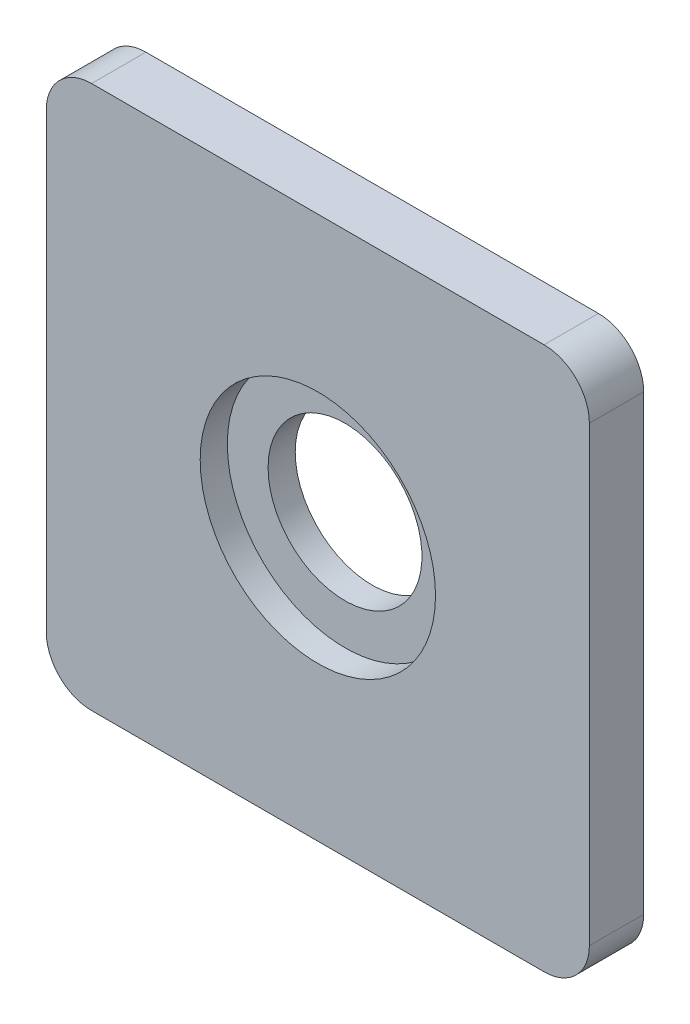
ISO-10303-21;
HEADER;
FILE_DESCRIPTION(('STEP AP214'),'2;1');
FILE_NAME('part.step','',(''),(''),'','','');
FILE_SCHEMA(('AUTOMOTIVE_DESIGN { 1 0 10303 214 1 1 1 1 }'));
ENDSEC;
DATA;
#1=APPLICATION_CONTEXT('core data for automotive mechanical design processes');
#2=APPLICATION_PROTOCOL_DEFINITION('international standard','automotive_design',2000,#1);
#3=PRODUCT_CONTEXT('',#1,'mechanical');
#4=PRODUCT('Part','Part','',(#3));
#5=PRODUCT_RELATED_PRODUCT_CATEGORY('part','',(#4));
#6=PRODUCT_DEFINITION_FORMATION('','',#4);
#7=PRODUCT_DEFINITION_CONTEXT('part definition',#1,'design');
#8=PRODUCT_DEFINITION('design','',#6,#7);
#9=PRODUCT_DEFINITION_SHAPE('','',#8);
#10=(LENGTH_UNIT() NAMED_UNIT(*) SI_UNIT(.MILLI.,.METRE.));
#11=(NAMED_UNIT(*) PLANE_ANGLE_UNIT() SI_UNIT($,.RADIAN.));
#12=(NAMED_UNIT(*) SI_UNIT($,.STERADIAN.) SOLID_ANGLE_UNIT());
#13=UNCERTAINTY_MEASURE_WITH_UNIT(LENGTH_MEASURE(1.E-05),#10,'distance_accuracy_value','');
#14=(GEOMETRIC_REPRESENTATION_CONTEXT(3) GLOBAL_UNCERTAINTY_ASSIGNED_CONTEXT((#13)) GLOBAL_UNIT_ASSIGNED_CONTEXT((#10,
#11,#12)) REPRESENTATION_CONTEXT('',''));
#15=CARTESIAN_POINT('',(0.,0.,0.));
#16=DIRECTION('',(0.,0.,1.));
#17=DIRECTION('',(1.,0.,0.));
#18=AXIS2_PLACEMENT_3D('',#15,#16,#17);
#19=CARTESIAN_POINT('',(15.,15.,2.24999999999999));
#20=DIRECTION('',(0.,0.,-1.));
#21=DIRECTION('',(-1.,0.,0.));
#22=AXIS2_PLACEMENT_3D('',#19,#20,#21);
#23=CYLINDRICAL_SURFACE('',#22,6.50000000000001);
#24=CARTESIAN_POINT('',(15.,15.,2.99999999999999));
#25=DIRECTION('',(0.,0.,-1.));
#26=DIRECTION('',(-1.,0.,0.));
#27=AXIS2_PLACEMENT_3D('',#24,#25,#26);
#28=CIRCLE('',#27,6.50000000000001);
#29=CARTESIAN_POINT('',(8.49999999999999,15.,2.99999999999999));
#30=VERTEX_POINT('',#29);
#31=EDGE_CURVE('E18',#30,#30,#28,.T.);
#32=ORIENTED_EDGE('',*,*,#31,.F.);
#33=EDGE_LOOP('',(#32));
#34=FACE_BOUND('',#33,.T.);
#35=CARTESIAN_POINT('',(15.,15.,1.49999999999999));
#36=DIRECTION('',(0.,0.,-1.));
#37=DIRECTION('',(-1.,0.,0.));
#38=AXIS2_PLACEMENT_3D('',#35,#36,#37);
#39=CIRCLE('',#38,6.50000000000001);
#40=CARTESIAN_POINT('',(8.49999999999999,15.,1.49999999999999));
#41=VERTEX_POINT('',#40);
#42=EDGE_CURVE('E101',#41,#41,#39,.T.);
#43=ORIENTED_EDGE('',*,*,#42,.T.);
#44=EDGE_LOOP('',(#43));
#45=FACE_BOUND('',#44,.T.);
#46=ADVANCED_FACE('F15',(#34,#45),#23,.F.);
#47=CARTESIAN_POINT('',(15.,15.,2.99999999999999));
#48=DIRECTION('',(0.,0.,1.));
#49=DIRECTION('',(1.,0.,0.));
#50=AXIS2_PLACEMENT_3D('',#47,#48,#49);
#51=PLANE('',#50);
#52=ORIENTED_EDGE('',*,*,#31,.T.);
#53=EDGE_LOOP('',(#52));
#54=FACE_BOUND('',#53,.T.);
#55=DIRECTION('',(1.,0.,0.));
#56=VECTOR('',#55,1.);
#57=CARTESIAN_POINT('',(2.50000000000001,30.,2.99999999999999));
#58=LINE('',#57,#56);
#59=CARTESIAN_POINT('',(2.50000000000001,30.,2.99999999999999));
#60=VERTEX_POINT('',#59);
#61=CARTESIAN_POINT('',(27.5,30.,2.99999999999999));
#62=VERTEX_POINT('',#61);
#63=EDGE_CURVE('E115',#60,#62,#58,.T.);
#64=ORIENTED_EDGE('',*,*,#63,.F.);
#65=CARTESIAN_POINT('',(2.50000000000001,27.5,2.99999999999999));
#66=DIRECTION('',(0.,0.,-1.));
#67=DIRECTION('',(-1.,0.,0.));
#68=AXIS2_PLACEMENT_3D('',#65,#66,#67);
#69=CIRCLE('',#68,2.50000000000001);
#70=CARTESIAN_POINT('',(0.,27.5,2.99999999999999));
#71=VERTEX_POINT('',#70);
#72=EDGE_CURVE('E136',#71,#60,#69,.T.);
#73=ORIENTED_EDGE('',*,*,#72,.F.);
#74=DIRECTION('',(0.,1.,0.));
#75=VECTOR('',#74,1.);
#76=CARTESIAN_POINT('',(0.,2.50000000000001,2.99999999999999));
#77=LINE('',#76,#75);
#78=CARTESIAN_POINT('',(0.,2.50000000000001,2.99999999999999));
#79=VERTEX_POINT('',#78);
#80=EDGE_CURVE('E111',#79,#71,#77,.T.);
#81=ORIENTED_EDGE('',*,*,#80,.F.);
#82=CARTESIAN_POINT('',(2.50000000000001,2.50000000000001,2.99999999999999));
#83=DIRECTION('',(0.,0.,-1.));
#84=DIRECTION('',(-1.,0.,0.));
#85=AXIS2_PLACEMENT_3D('',#82,#83,#84);
#86=CIRCLE('',#85,2.50000000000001);
#87=CARTESIAN_POINT('',(2.50000000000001,0.,2.99999999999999));
#88=VERTEX_POINT('',#87);
#89=EDGE_CURVE('E97',#88,#79,#86,.T.);
#90=ORIENTED_EDGE('',*,*,#89,.F.);
#91=DIRECTION('',(1.,0.,0.));
#92=VECTOR('',#91,1.);
#93=CARTESIAN_POINT('',(27.5,0.,2.99999999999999));
#94=LINE('',#93,#92);
#95=CARTESIAN_POINT('',(27.5,0.,2.99999999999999));
#96=VERTEX_POINT('',#95);
#97=EDGE_CURVE('E91',#96,#88,#94,.F.);
#98=ORIENTED_EDGE('',*,*,#97,.F.);
#99=CARTESIAN_POINT('',(27.5,2.50000000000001,2.99999999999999));
#100=DIRECTION('',(0.,0.,-1.));
#101=DIRECTION('',(-1.,0.,0.));
#102=AXIS2_PLACEMENT_3D('',#99,#100,#101);
#103=CIRCLE('',#102,2.50000000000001);
#104=CARTESIAN_POINT('',(30.,2.50000000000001,2.99999999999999));
#105=VERTEX_POINT('',#104);
#106=EDGE_CURVE('E82',#105,#96,#103,.T.);
#107=ORIENTED_EDGE('',*,*,#106,.F.);
#108=DIRECTION('',(0.,1.,0.));
#109=VECTOR('',#108,1.);
#110=CARTESIAN_POINT('',(30.,27.5,2.99999999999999));
#111=LINE('',#110,#109);
#112=CARTESIAN_POINT('',(30.,27.5,2.99999999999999));
#113=VERTEX_POINT('',#112);
#114=EDGE_CURVE('E77',#113,#105,#111,.F.);
#115=ORIENTED_EDGE('',*,*,#114,.F.);
#116=CARTESIAN_POINT('',(27.5,27.5,2.99999999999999));
#117=DIRECTION('',(0.,0.,-1.));
#118=DIRECTION('',(-1.,0.,0.));
#119=AXIS2_PLACEMENT_3D('',#116,#117,#118);
#120=CIRCLE('',#119,2.50000000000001);
#121=EDGE_CURVE('E138',#62,#113,#120,.T.);
#122=ORIENTED_EDGE('',*,*,#121,.F.);
#123=EDGE_LOOP('',(#64,#73,#81,#90,#98,#107,#115,#122));
#124=FACE_BOUND('',#123,.T.);
#125=ADVANCED_FACE('F95',(#54,#124),#51,.T.);
#126=CARTESIAN_POINT('',(15.,15.,1.49999999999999));
#127=DIRECTION('',(0.,0.,-1.));
#128=DIRECTION('',(-1.,0.,0.));
#129=AXIS2_PLACEMENT_3D('',#126,#127,#128);
#130=PLANE('',#129);
#131=CARTESIAN_POINT('',(15.,15.,1.49999999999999));
#132=DIRECTION('',(0.,0.,-1.));
#133=DIRECTION('',(-1.,0.,0.));
#134=AXIS2_PLACEMENT_3D('',#131,#132,#133);
#135=CIRCLE('',#134,4.24999999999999);
#136=CARTESIAN_POINT('',(10.75,15.,1.49999999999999));
#137=VERTEX_POINT('',#136);
#138=EDGE_CURVE('E131',#137,#137,#135,.T.);
#139=ORIENTED_EDGE('',*,*,#138,.T.);
#140=EDGE_LOOP('',(#139));
#141=FACE_BOUND('',#140,.T.);
#142=ORIENTED_EDGE('',*,*,#42,.F.);
#143=EDGE_LOOP('',(#142));
#144=FACE_BOUND('',#143,.T.);
#145=ADVANCED_FACE('F151',(#141,#144),#130,.F.);
#146=CARTESIAN_POINT('',(27.5,0.,0.));
#147=DIRECTION('',(0.,-1.,0.));
#148=DIRECTION('',(0.,0.,-1.));
#149=AXIS2_PLACEMENT_3D('',#146,#147,#148);
#150=PLANE('',#149);
#151=DIRECTION('',(1.,0.,0.));
#152=VECTOR('',#151,1.);
#153=CARTESIAN_POINT('',(15.,0.,0.));
#154=LINE('',#153,#152);
#155=CARTESIAN_POINT('',(2.50000000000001,0.,0.));
#156=VERTEX_POINT('',#155);
#157=CARTESIAN_POINT('',(27.5,0.,0.));
#158=VERTEX_POINT('',#157);
#159=EDGE_CURVE('E105',#156,#158,#154,.T.);
#160=ORIENTED_EDGE('',*,*,#159,.T.);
#161=DIRECTION('',(0.,0.,-1.));
#162=VECTOR('',#161,1.);
#163=CARTESIAN_POINT('',(27.5,0.,0.));
#164=LINE('',#163,#162);
#165=EDGE_CURVE('E87',#96,#158,#164,.T.);
#166=ORIENTED_EDGE('',*,*,#165,.F.);
#167=ORIENTED_EDGE('',*,*,#97,.T.);
#168=DIRECTION('',(0.,0.,-1.));
#169=VECTOR('',#168,1.);
#170=CARTESIAN_POINT('',(2.50000000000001,0.,0.));
#171=LINE('',#170,#169);
#172=EDGE_CURVE('E134',#156,#88,#171,.F.);
#173=ORIENTED_EDGE('',*,*,#172,.F.);
#174=EDGE_LOOP('',(#160,#166,#167,#173));
#175=FACE_BOUND('',#174,.T.);
#176=ADVANCED_FACE('F104',(#175),#150,.T.);
#177=CARTESIAN_POINT('',(27.5,2.50000000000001,0.));
#178=DIRECTION('',(0.,0.,-1.));
#179=DIRECTION('',(-1.,0.,0.));
#180=AXIS2_PLACEMENT_3D('',#177,#178,#179);
#181=CYLINDRICAL_SURFACE('',#180,2.50000000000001);
#182=CARTESIAN_POINT('',(27.5,2.50000000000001,0.));
#183=DIRECTION('',(0.,0.,-1.));
#184=DIRECTION('',(-1.,0.,0.));
#185=AXIS2_PLACEMENT_3D('',#182,#183,#184);
#186=CIRCLE('',#185,2.50000000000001);
#187=CARTESIAN_POINT('',(30.,2.50000000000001,0.));
#188=VERTEX_POINT('',#187);
#189=EDGE_CURVE('E129',#158,#188,#186,.F.);
#190=ORIENTED_EDGE('',*,*,#189,.T.);
#191=DIRECTION('',(0.,0.,-1.));
#192=VECTOR('',#191,1.);
#193=CARTESIAN_POINT('',(30.,2.50000000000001,0.));
#194=LINE('',#193,#192);
#195=EDGE_CURVE('E89',#105,#188,#194,.T.);
#196=ORIENTED_EDGE('',*,*,#195,.F.);
#197=ORIENTED_EDGE('',*,*,#106,.T.);
#198=ORIENTED_EDGE('',*,*,#165,.T.);
#199=EDGE_LOOP('',(#190,#196,#197,#198));
#200=FACE_BOUND('',#199,.T.);
#201=ADVANCED_FACE('F85',(#200),#181,.T.);
#202=CARTESIAN_POINT('',(30.,27.5,0.));
#203=DIRECTION('',(1.,0.,0.));
#204=DIRECTION('',(0.,0.,-1.));
#205=AXIS2_PLACEMENT_3D('',#202,#203,#204);
#206=PLANE('',#205);
#207=DIRECTION('',(0.,1.,0.));
#208=VECTOR('',#207,1.);
#209=CARTESIAN_POINT('',(30.,15.,0.));
#210=LINE('',#209,#208);
#211=CARTESIAN_POINT('',(30.,27.5,0.));
#212=VERTEX_POINT('',#211);
#213=EDGE_CURVE('E128',#188,#212,#210,.T.);
#214=ORIENTED_EDGE('',*,*,#213,.T.);
#215=DIRECTION('',(0.,0.,-1.));
#216=VECTOR('',#215,1.);
#217=CARTESIAN_POINT('',(30.,27.5,0.));
#218=LINE('',#217,#216);
#219=EDGE_CURVE('E117',#113,#212,#218,.T.);
#220=ORIENTED_EDGE('',*,*,#219,.F.);
#221=ORIENTED_EDGE('',*,*,#114,.T.);
#222=ORIENTED_EDGE('',*,*,#195,.T.);
#223=EDGE_LOOP('',(#214,#220,#221,#222));
#224=FACE_BOUND('',#223,.T.);
#225=ADVANCED_FACE('F183',(#224),#206,.T.);
#226=CARTESIAN_POINT('',(27.5,27.5,0.));
#227=DIRECTION('',(0.,0.,-1.));
#228=DIRECTION('',(-1.,0.,0.));
#229=AXIS2_PLACEMENT_3D('',#226,#227,#228);
#230=CYLINDRICAL_SURFACE('',#229,2.50000000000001);
#231=CARTESIAN_POINT('',(27.5,27.5,0.));
#232=DIRECTION('',(0.,0.,-1.));
#233=DIRECTION('',(-1.,0.,0.));
#234=AXIS2_PLACEMENT_3D('',#231,#232,#233);
#235=CIRCLE('',#234,2.50000000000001);
#236=CARTESIAN_POINT('',(27.5,30.,0.));
#237=VERTEX_POINT('',#236);
#238=EDGE_CURVE('E125',#212,#237,#235,.F.);
#239=ORIENTED_EDGE('',*,*,#238,.T.);
#240=DIRECTION('',(0.,0.,1.));
#241=VECTOR('',#240,1.);
#242=CARTESIAN_POINT('',(27.5,30.,0.));
#243=LINE('',#242,#241);
#244=EDGE_CURVE('E116',#62,#237,#243,.F.);
#245=ORIENTED_EDGE('',*,*,#244,.F.);
#246=ORIENTED_EDGE('',*,*,#121,.T.);
#247=ORIENTED_EDGE('',*,*,#219,.T.);
#248=EDGE_LOOP('',(#239,#245,#246,#247));
#249=FACE_BOUND('',#248,.T.);
#250=ADVANCED_FACE('F179',(#249),#230,.T.);
#251=CARTESIAN_POINT('',(2.50000000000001,30.,0.));
#252=DIRECTION('',(0.,1.,0.));
#253=DIRECTION('',(0.,0.,1.));
#254=AXIS2_PLACEMENT_3D('',#251,#252,#253);
#255=PLANE('',#254);
#256=DIRECTION('',(1.,0.,0.));
#257=VECTOR('',#256,1.);
#258=CARTESIAN_POINT('',(15.,30.,0.));
#259=LINE('',#258,#257);
#260=CARTESIAN_POINT('',(2.50000000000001,30.,0.));
#261=VERTEX_POINT('',#260);
#262=EDGE_CURVE('E124',#237,#261,#259,.F.);
#263=ORIENTED_EDGE('',*,*,#262,.T.);
#264=DIRECTION('',(0.,0.,-1.));
#265=VECTOR('',#264,1.);
#266=CARTESIAN_POINT('',(2.50000000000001,30.,0.));
#267=LINE('',#266,#265);
#268=EDGE_CURVE('E114',#60,#261,#267,.T.);
#269=ORIENTED_EDGE('',*,*,#268,.F.);
#270=ORIENTED_EDGE('',*,*,#63,.T.);
#271=ORIENTED_EDGE('',*,*,#244,.T.);
#272=EDGE_LOOP('',(#263,#269,#270,#271));
#273=FACE_BOUND('',#272,.T.);
#274=ADVANCED_FACE('F175',(#273),#255,.T.);
#275=CARTESIAN_POINT('',(2.50000000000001,27.5,0.));
#276=DIRECTION('',(0.,0.,-1.));
#277=DIRECTION('',(-1.,0.,0.));
#278=AXIS2_PLACEMENT_3D('',#275,#276,#277);
#279=CYLINDRICAL_SURFACE('',#278,2.50000000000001);
#280=CARTESIAN_POINT('',(2.50000000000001,27.5,0.));
#281=DIRECTION('',(0.,0.,-1.));
#282=DIRECTION('',(-1.,0.,0.));
#283=AXIS2_PLACEMENT_3D('',#280,#281,#282);
#284=CIRCLE('',#283,2.50000000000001);
#285=CARTESIAN_POINT('',(0.,27.5,0.));
#286=VERTEX_POINT('',#285);
#287=EDGE_CURVE('E121',#261,#286,#284,.F.);
#288=ORIENTED_EDGE('',*,*,#287,.T.);
#289=DIRECTION('',(0.,0.,1.));
#290=VECTOR('',#289,1.);
#291=CARTESIAN_POINT('',(0.,27.5,0.));
#292=LINE('',#291,#290);
#293=EDGE_CURVE('E113',#71,#286,#292,.F.);
#294=ORIENTED_EDGE('',*,*,#293,.F.);
#295=ORIENTED_EDGE('',*,*,#72,.T.);
#296=ORIENTED_EDGE('',*,*,#268,.T.);
#297=EDGE_LOOP('',(#288,#294,#295,#296));
#298=FACE_BOUND('',#297,.T.);
#299=ADVANCED_FACE('F171',(#298),#279,.T.);
#300=CARTESIAN_POINT('',(0.,2.50000000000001,0.));
#301=DIRECTION('',(-1.,0.,0.));
#302=DIRECTION('',(0.,0.,1.));
#303=AXIS2_PLACEMENT_3D('',#300,#301,#302);
#304=PLANE('',#303);
#305=DIRECTION('',(0.,1.,0.));
#306=VECTOR('',#305,1.);
#307=CARTESIAN_POINT('',(0.,15.,0.));
#308=LINE('',#307,#306);
#309=CARTESIAN_POINT('',(0.,2.50000000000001,0.));
#310=VERTEX_POINT('',#309);
#311=EDGE_CURVE('E120',#286,#310,#308,.F.);
#312=ORIENTED_EDGE('',*,*,#311,.T.);
#313=DIRECTION('',(0.,0.,-1.));
#314=VECTOR('',#313,1.);
#315=CARTESIAN_POINT('',(0.,2.50000000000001,0.));
#316=LINE('',#315,#314);
#317=EDGE_CURVE('E33',#79,#310,#316,.T.);
#318=ORIENTED_EDGE('',*,*,#317,.F.);
#319=ORIENTED_EDGE('',*,*,#80,.T.);
#320=ORIENTED_EDGE('',*,*,#293,.T.);
#321=EDGE_LOOP('',(#312,#318,#319,#320));
#322=FACE_BOUND('',#321,.T.);
#323=ADVANCED_FACE('F168',(#322),#304,.T.);
#324=CARTESIAN_POINT('',(2.50000000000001,2.50000000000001,0.));
#325=DIRECTION('',(0.,0.,-1.));
#326=DIRECTION('',(-1.,0.,0.));
#327=AXIS2_PLACEMENT_3D('',#324,#325,#326);
#328=CYLINDRICAL_SURFACE('',#327,2.50000000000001);
#329=CARTESIAN_POINT('',(2.50000000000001,2.50000000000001,0.));
#330=DIRECTION('',(0.,0.,-1.));
#331=DIRECTION('',(-1.,0.,0.));
#332=AXIS2_PLACEMENT_3D('',#329,#330,#331);
#333=CIRCLE('',#332,2.50000000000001);
#334=EDGE_CURVE('E24',#310,#156,#333,.F.);
#335=ORIENTED_EDGE('',*,*,#334,.T.);
#336=ORIENTED_EDGE('',*,*,#172,.T.);
#337=ORIENTED_EDGE('',*,*,#89,.T.);
#338=ORIENTED_EDGE('',*,*,#317,.T.);
#339=EDGE_LOOP('',(#335,#336,#337,#338));
#340=FACE_BOUND('',#339,.T.);
#341=ADVANCED_FACE('F160',(#340),#328,.T.);
#342=CARTESIAN_POINT('',(15.,15.,1.55));
#343=DIRECTION('',(0.,0.,-1.));
#344=DIRECTION('',(-1.,0.,0.));
#345=AXIS2_PLACEMENT_3D('',#342,#343,#344);
#346=CYLINDRICAL_SURFACE('',#345,4.24999999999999);
#347=ORIENTED_EDGE('',*,*,#138,.F.);
#348=EDGE_LOOP('',(#347));
#349=FACE_BOUND('',#348,.T.);
#350=CARTESIAN_POINT('',(15.,15.,0.));
#351=DIRECTION('',(0.,0.,-1.));
#352=DIRECTION('',(-1.,0.,0.));
#353=AXIS2_PLACEMENT_3D('',#350,#351,#352);
#354=CIRCLE('',#353,4.24999999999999);
#355=CARTESIAN_POINT('',(10.75,15.,0.));
#356=VERTEX_POINT('',#355);
#357=EDGE_CURVE('E10',#356,#356,#354,.T.);
#358=ORIENTED_EDGE('',*,*,#357,.T.);
#359=EDGE_LOOP('',(#358));
#360=FACE_BOUND('',#359,.T.);
#361=ADVANCED_FACE('F154',(#349,#360),#346,.F.);
#362=CARTESIAN_POINT('',(15.,15.,0.));
#363=DIRECTION('',(0.,0.,1.));
#364=DIRECTION('',(1.,0.,0.));
#365=AXIS2_PLACEMENT_3D('',#362,#363,#364);
#366=PLANE('',#365);
#367=ORIENTED_EDGE('',*,*,#357,.F.);
#368=EDGE_LOOP('',(#367));
#369=FACE_BOUND('',#368,.T.);
#370=ORIENTED_EDGE('',*,*,#311,.F.);
#371=ORIENTED_EDGE('',*,*,#287,.F.);
#372=ORIENTED_EDGE('',*,*,#262,.F.);
#373=ORIENTED_EDGE('',*,*,#238,.F.);
#374=ORIENTED_EDGE('',*,*,#213,.F.);
#375=ORIENTED_EDGE('',*,*,#189,.F.);
#376=ORIENTED_EDGE('',*,*,#159,.F.);
#377=ORIENTED_EDGE('',*,*,#334,.F.);
#378=EDGE_LOOP('',(#370,#371,#372,#373,#374,#375,#376,#377));
#379=FACE_BOUND('',#378,.T.);
#380=ADVANCED_FACE('F152',(#369,#379),#366,.F.);
#381=CLOSED_SHELL('',(#46,#125,#145,#176,#201,#225,#250,#274,#299,#323,#341,#361,#380));
#382=MANIFOLD_SOLID_BREP('B1',#381);
#383=ADVANCED_BREP_SHAPE_REPRESENTATION('',(#18,#382),#14);
#384=SHAPE_DEFINITION_REPRESENTATION(#9,#383);
ENDSEC;
END-ISO-10303-21;
